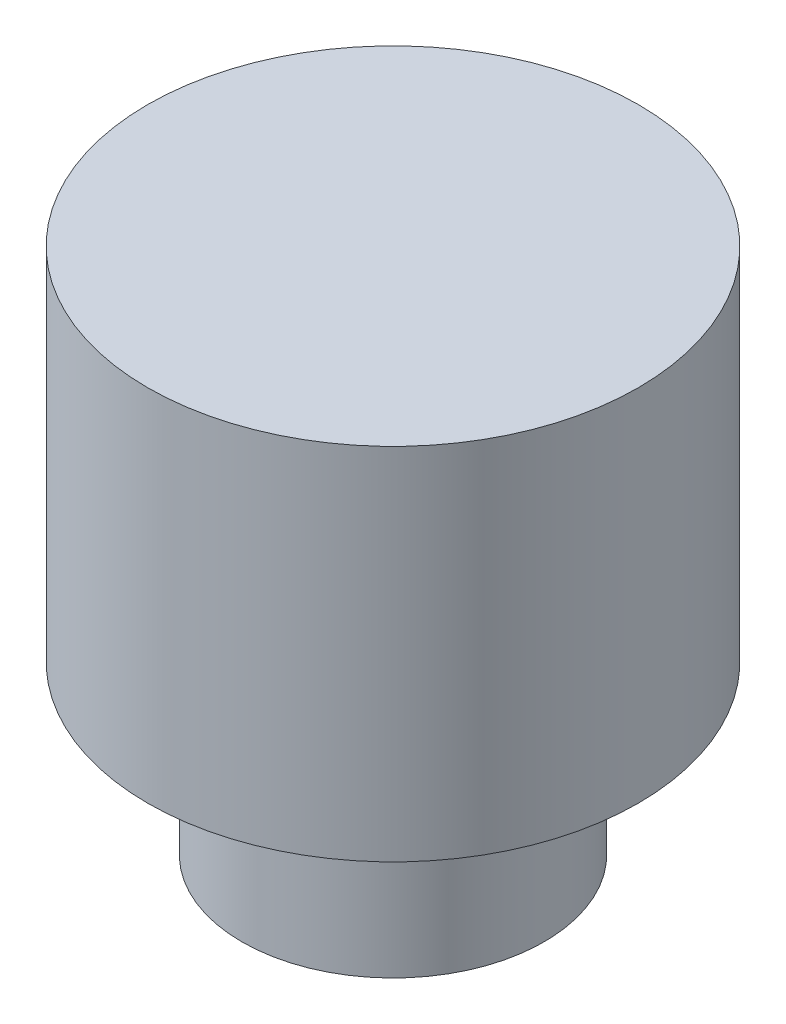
ISO-10303-21;
HEADER;
FILE_DESCRIPTION(('STEP AP214'),'2;1');
FILE_NAME('part.step','',(''),(''),'','','');
FILE_SCHEMA(('AUTOMOTIVE_DESIGN { 1 0 10303 214 1 1 1 1 }'));
ENDSEC;
DATA;
#1=APPLICATION_CONTEXT('core data for automotive mechanical design processes');
#2=APPLICATION_PROTOCOL_DEFINITION('international standard','automotive_design',2000,#1);
#3=PRODUCT_CONTEXT('',#1,'mechanical');
#4=PRODUCT('Part','Part','',(#3));
#5=PRODUCT_RELATED_PRODUCT_CATEGORY('part','',(#4));
#6=PRODUCT_DEFINITION_FORMATION('','',#4);
#7=PRODUCT_DEFINITION_CONTEXT('part definition',#1,'design');
#8=PRODUCT_DEFINITION('design','',#6,#7);
#9=PRODUCT_DEFINITION_SHAPE('','',#8);
#10=(LENGTH_UNIT() NAMED_UNIT(*) SI_UNIT(.MILLI.,.METRE.));
#11=(NAMED_UNIT(*) PLANE_ANGLE_UNIT() SI_UNIT($,.RADIAN.));
#12=(NAMED_UNIT(*) SI_UNIT($,.STERADIAN.) SOLID_ANGLE_UNIT());
#13=UNCERTAINTY_MEASURE_WITH_UNIT(LENGTH_MEASURE(1.E-05),#10,'distance_accuracy_value','');
#14=(GEOMETRIC_REPRESENTATION_CONTEXT(3) GLOBAL_UNCERTAINTY_ASSIGNED_CONTEXT((#13)) GLOBAL_UNIT_ASSIGNED_CONTEXT((#10,
#11,#12)) REPRESENTATION_CONTEXT('',''));
#15=CARTESIAN_POINT('',(0.,0.,0.));
#16=DIRECTION('',(0.,0.,1.));
#17=DIRECTION('',(1.,0.,0.));
#18=AXIS2_PLACEMENT_3D('',#15,#16,#17);
#19=CARTESIAN_POINT('',(0.,11.61,0.));
#20=DIRECTION('',(0.,-1.,0.));
#21=DIRECTION('',(0.,0.,-1.));
#22=AXIS2_PLACEMENT_3D('',#19,#20,#21);
#23=CYLINDRICAL_SURFACE('',#22,10.5);
#24=CARTESIAN_POINT('',(0.,11.61,0.));
#25=DIRECTION('',(0.,1.,0.));
#26=DIRECTION('',(0.,0.,1.));
#27=AXIS2_PLACEMENT_3D('',#24,#25,#26);
#28=CIRCLE('',#27,10.5);
#29=CARTESIAN_POINT('',(0.,11.61,10.5));
#30=VERTEX_POINT('',#29);
#31=EDGE_CURVE('E10',#30,#30,#28,.T.);
#32=ORIENTED_EDGE('',*,*,#31,.F.);
#33=EDGE_LOOP('',(#32));
#34=FACE_BOUND('',#33,.T.);
#35=CARTESIAN_POINT('',(0.,0.,0.));
#36=DIRECTION('',(0.,1.,0.));
#37=DIRECTION('',(0.,0.,1.));
#38=AXIS2_PLACEMENT_3D('',#35,#36,#37);
#39=CIRCLE('',#38,10.5);
#40=CARTESIAN_POINT('',(0.,0.,10.5));
#41=VERTEX_POINT('',#40);
#42=EDGE_CURVE('E34',#41,#41,#39,.T.);
#43=ORIENTED_EDGE('',*,*,#42,.T.);
#44=EDGE_LOOP('',(#43));
#45=FACE_BOUND('',#44,.T.);
#46=ADVANCED_FACE('F31',(#34,#45),#23,.T.);
#47=CARTESIAN_POINT('',(0.,0.,0.));
#48=DIRECTION('',(0.,1.,0.));
#49=DIRECTION('',(0.,0.,1.));
#50=AXIS2_PLACEMENT_3D('',#47,#48,#49);
#51=PLANE('',#50);
#52=ORIENTED_EDGE('',*,*,#42,.F.);
#53=EDGE_LOOP('',(#52));
#54=FACE_BOUND('',#53,.T.);
#55=ADVANCED_FACE('F59',(#54),#51,.F.);
#56=CARTESIAN_POINT('',(0.,11.61,0.));
#57=DIRECTION('',(0.,1.,0.));
#58=DIRECTION('',(0.,0.,1.));
#59=AXIS2_PLACEMENT_3D('',#56,#57,#58);
#60=PLANE('',#59);
#61=CARTESIAN_POINT('',(0.,11.61,0.));
#62=DIRECTION('',(0.,1.,0.));
#63=DIRECTION('',(0.,0.,1.));
#64=AXIS2_PLACEMENT_3D('',#61,#62,#63);
#65=CIRCLE('',#64,17.04);
#66=CARTESIAN_POINT('',(0.,11.61,17.04));
#67=VERTEX_POINT('',#66);
#68=EDGE_CURVE('E43',#67,#67,#65,.T.);
#69=ORIENTED_EDGE('',*,*,#68,.F.);
#70=EDGE_LOOP('',(#69));
#71=FACE_BOUND('',#70,.T.);
#72=ORIENTED_EDGE('',*,*,#31,.T.);
#73=EDGE_LOOP('',(#72));
#74=FACE_BOUND('',#73,.T.);
#75=ADVANCED_FACE('F54',(#71,#74),#60,.F.);
#76=CARTESIAN_POINT('',(0.,36.61,0.));
#77=DIRECTION('',(0.,-1.,0.));
#78=DIRECTION('',(0.,0.,-1.));
#79=AXIS2_PLACEMENT_3D('',#76,#77,#78);
#80=CYLINDRICAL_SURFACE('',#79,17.04);
#81=CARTESIAN_POINT('',(0.,36.61,0.));
#82=DIRECTION('',(0.,1.,0.));
#83=DIRECTION('',(0.,0.,1.));
#84=AXIS2_PLACEMENT_3D('',#81,#82,#83);
#85=CIRCLE('',#84,17.04);
#86=CARTESIAN_POINT('',(0.,36.61,17.04));
#87=VERTEX_POINT('',#86);
#88=EDGE_CURVE('E41',#87,#87,#85,.T.);
#89=ORIENTED_EDGE('',*,*,#88,.F.);
#90=EDGE_LOOP('',(#89));
#91=FACE_BOUND('',#90,.T.);
#92=ORIENTED_EDGE('',*,*,#68,.T.);
#93=EDGE_LOOP('',(#92));
#94=FACE_BOUND('',#93,.T.);
#95=ADVANCED_FACE('F51',(#91,#94),#80,.T.);
#96=CARTESIAN_POINT('',(0.,36.61,0.));
#97=DIRECTION('',(0.,1.,0.));
#98=DIRECTION('',(0.,0.,1.));
#99=AXIS2_PLACEMENT_3D('',#96,#97,#98);
#100=PLANE('',#99);
#101=ORIENTED_EDGE('',*,*,#88,.T.);
#102=EDGE_LOOP('',(#101));
#103=FACE_BOUND('',#102,.T.);
#104=ADVANCED_FACE('F49',(#103),#100,.T.);
#105=CLOSED_SHELL('',(#46,#55,#75,#95,#104));
#106=MANIFOLD_SOLID_BREP('B2',#105);
#107=ADVANCED_BREP_SHAPE_REPRESENTATION('',(#18,#106),#14);
#108=SHAPE_DEFINITION_REPRESENTATION(#9,#107);
ENDSEC;
END-ISO-10303-21;
